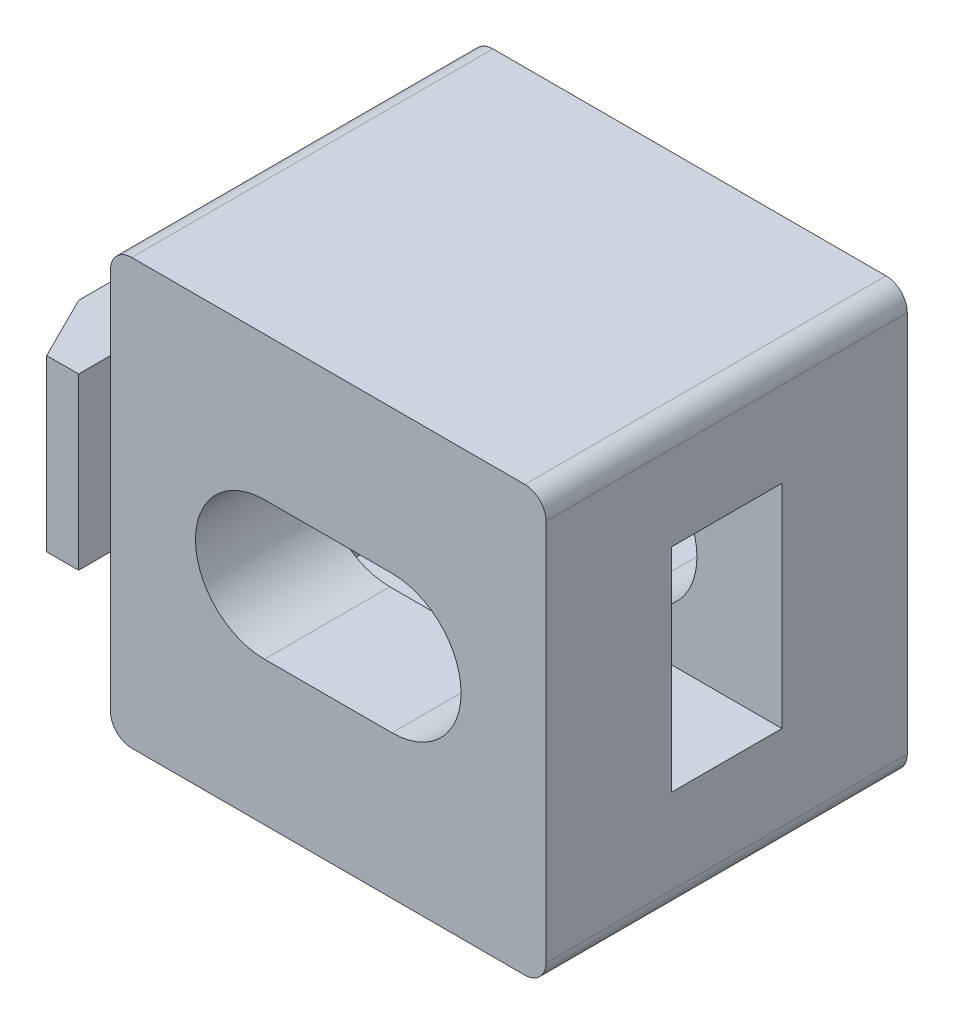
ISO-10303-21;
HEADER;
FILE_DESCRIPTION(('STEP AP214'),'2;1');
FILE_NAME('part.step','',(''),(''),'','','');
FILE_SCHEMA(('AUTOMOTIVE_DESIGN { 1 0 10303 214 1 1 1 1 }'));
ENDSEC;
DATA;
#1=APPLICATION_CONTEXT('core data for automotive mechanical design processes');
#2=APPLICATION_PROTOCOL_DEFINITION('international standard','automotive_design',2000,#1);
#3=PRODUCT_CONTEXT('',#1,'mechanical');
#4=PRODUCT('Part','Part','',(#3));
#5=PRODUCT_RELATED_PRODUCT_CATEGORY('part','',(#4));
#6=PRODUCT_DEFINITION_FORMATION('','',#4);
#7=PRODUCT_DEFINITION_CONTEXT('part definition',#1,'design');
#8=PRODUCT_DEFINITION('design','',#6,#7);
#9=PRODUCT_DEFINITION_SHAPE('','',#8);
#10=(LENGTH_UNIT() NAMED_UNIT(*) SI_UNIT(.MILLI.,.METRE.));
#11=(NAMED_UNIT(*) PLANE_ANGLE_UNIT() SI_UNIT($,.RADIAN.));
#12=(NAMED_UNIT(*) SI_UNIT($,.STERADIAN.) SOLID_ANGLE_UNIT());
#13=UNCERTAINTY_MEASURE_WITH_UNIT(LENGTH_MEASURE(1.E-05),#10,'distance_accuracy_value','');
#14=(GEOMETRIC_REPRESENTATION_CONTEXT(3) GLOBAL_UNCERTAINTY_ASSIGNED_CONTEXT((#13)) GLOBAL_UNIT_ASSIGNED_CONTEXT((#10,
#11,#12)) REPRESENTATION_CONTEXT('',''));
#15=CARTESIAN_POINT('',(0.,0.,0.));
#16=DIRECTION('',(0.,0.,1.));
#17=DIRECTION('',(1.,0.,0.));
#18=AXIS2_PLACEMENT_3D('',#15,#16,#17);
#19=CARTESIAN_POINT('',(-10.25,10.,8.5));
#20=DIRECTION('',(1.,0.,0.));
#21=DIRECTION('',(0.,1.,0.));
#22=AXIS2_PLACEMENT_3D('',#19,#20,#21);
#23=PLANE('',#22);
#24=DIRECTION('',(0.,-1.,0.));
#25=VECTOR('',#24,1.);
#26=CARTESIAN_POINT('',(-10.25,10.,-8.5));
#27=LINE('',#26,#25);
#28=CARTESIAN_POINT('',(-10.25,9.,-8.5));
#29=VERTEX_POINT('',#28);
#30=CARTESIAN_POINT('',(-10.25,-9.,-8.5));
#31=VERTEX_POINT('',#30);
#32=EDGE_CURVE('E377',#29,#31,#27,.T.);
#33=ORIENTED_EDGE('',*,*,#32,.T.);
#34=DIRECTION('',(0.,0.,-1.));
#35=VECTOR('',#34,1.);
#36=CARTESIAN_POINT('',(-10.25,-9.,8.5));
#37=LINE('',#36,#35);
#38=CARTESIAN_POINT('',(-10.25,-9.,8.5));
#39=VERTEX_POINT('',#38);
#40=EDGE_CURVE('E342',#31,#39,#37,.F.);
#41=ORIENTED_EDGE('',*,*,#40,.T.);
#42=DIRECTION('',(0.,-1.,0.));
#43=VECTOR('',#42,1.);
#44=CARTESIAN_POINT('',(-10.25,10.,8.5));
#45=LINE('',#44,#43);
#46=CARTESIAN_POINT('',(-10.25,9.,8.5));
#47=VERTEX_POINT('',#46);
#48=EDGE_CURVE('E375',#47,#39,#45,.T.);
#49=ORIENTED_EDGE('',*,*,#48,.F.);
#50=DIRECTION('',(0.,0.,-1.));
#51=VECTOR('',#50,1.);
#52=CARTESIAN_POINT('',(-10.25,9.,8.5));
#53=LINE('',#52,#51);
#54=EDGE_CURVE('E339',#47,#29,#53,.T.);
#55=ORIENTED_EDGE('',*,*,#54,.T.);
#56=EDGE_LOOP('',(#33,#41,#49,#55));
#57=FACE_BOUND('',#56,.T.);
#58=DIRECTION('',(0.,-1.,0.));
#59=VECTOR('',#58,1.);
#60=CARTESIAN_POINT('',(-10.25,4.,-2.5));
#61=LINE('',#60,#59);
#62=CARTESIAN_POINT('',(-10.25,4.,-2.5));
#63=VERTEX_POINT('',#62);
#64=CARTESIAN_POINT('',(-10.25,-0.999999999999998,-2.5));
#65=VERTEX_POINT('',#64);
#66=EDGE_CURVE('E422',#63,#65,#61,.T.);
#67=ORIENTED_EDGE('',*,*,#66,.F.);
#68=DIRECTION('',(0.,0.,-1.));
#69=VECTOR('',#68,1.);
#70=CARTESIAN_POINT('',(-10.25,4.,-2.5));
#71=LINE('',#70,#69);
#72=CARTESIAN_POINT('',(-10.25,4.,2.5));
#73=VERTEX_POINT('',#72);
#74=EDGE_CURVE('E309',#73,#63,#71,.T.);
#75=ORIENTED_EDGE('',*,*,#74,.F.);
#76=CARTESIAN_POINT('',(-10.25,1.,2.5));
#77=DIRECTION('',(1.,0.,0.));
#78=DIRECTION('',(0.,1.,0.));
#79=AXIS2_PLACEMENT_3D('',#76,#77,#78);
#80=CIRCLE('',#79,3.);
#81=CARTESIAN_POINT('',(-10.25,1.,5.5));
#82=VERTEX_POINT('',#81);
#83=EDGE_CURVE('E328',#73,#82,#80,.T.);
#84=ORIENTED_EDGE('',*,*,#83,.T.);
#85=DIRECTION('',(0.,1.,0.));
#86=VECTOR('',#85,1.);
#87=CARTESIAN_POINT('',(-10.25,4.,5.5));
#88=LINE('',#87,#86);
#89=CARTESIAN_POINT('',(-10.25,-4.,5.5));
#90=VERTEX_POINT('',#89);
#91=EDGE_CURVE('E416',#90,#82,#88,.T.);
#92=ORIENTED_EDGE('',*,*,#91,.F.);
#93=DIRECTION('',(0.,0.,1.));
#94=VECTOR('',#93,1.);
#95=CARTESIAN_POINT('',(-10.25,-4.,-2.5));
#96=LINE('',#95,#94);
#97=CARTESIAN_POINT('',(-10.25,-4.,0.5));
#98=VERTEX_POINT('',#97);
#99=EDGE_CURVE('E424',#98,#90,#96,.T.);
#100=ORIENTED_EDGE('',*,*,#99,.F.);
#101=CARTESIAN_POINT('',(-10.25,-0.999999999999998,0.5));
#102=DIRECTION('',(1.,0.,0.));
#103=DIRECTION('',(0.,1.,0.));
#104=AXIS2_PLACEMENT_3D('',#101,#102,#103);
#105=CIRCLE('',#104,3.);
#106=EDGE_CURVE('E393',#98,#65,#105,.T.);
#107=ORIENTED_EDGE('',*,*,#106,.T.);
#108=EDGE_LOOP('',(#67,#75,#84,#92,#100,#107));
#109=FACE_BOUND('',#108,.T.);
#110=ADVANCED_FACE('F37',(#57,#109),#23,.F.);
#111=CARTESIAN_POINT('',(-3.,0.,8.5));
#112=DIRECTION('',(0.,0.,-1.));
#113=DIRECTION('',(-1.,0.,0.));
#114=AXIS2_PLACEMENT_3D('',#111,#112,#113);
#115=CYLINDRICAL_SURFACE('',#114,3.25);
#116=CARTESIAN_POINT('',(-3.,0.,2.6));
#117=DIRECTION('',(0.,0.,1.));
#118=DIRECTION('',(0.,-1.,0.));
#119=AXIS2_PLACEMENT_3D('',#116,#117,#118);
#120=CIRCLE('',#119,3.25);
#121=CARTESIAN_POINT('',(-3.,3.25,2.6));
#122=VERTEX_POINT('',#121);
#123=CARTESIAN_POINT('',(-3.,-3.25,2.6));
#124=VERTEX_POINT('',#123);
#125=EDGE_CURVE('E469',#122,#124,#120,.T.);
#126=ORIENTED_EDGE('',*,*,#125,.F.);
#127=DIRECTION('',(0.,0.,-1.));
#128=VECTOR('',#127,1.);
#129=CARTESIAN_POINT('',(-3.,3.25,8.5));
#130=LINE('',#129,#128);
#131=CARTESIAN_POINT('',(-3.,3.25,8.5));
#132=VERTEX_POINT('',#131);
#133=EDGE_CURVE('E493',#132,#122,#130,.T.);
#134=ORIENTED_EDGE('',*,*,#133,.F.);
#135=CARTESIAN_POINT('',(-3.,0.,8.5));
#136=DIRECTION('',(0.,0.,1.));
#137=DIRECTION('',(1.,0.,0.));
#138=AXIS2_PLACEMENT_3D('',#135,#136,#137);
#139=CIRCLE('',#138,3.25);
#140=CARTESIAN_POINT('',(-3.,-3.25,8.5));
#141=VERTEX_POINT('',#140);
#142=EDGE_CURVE('E472',#132,#141,#139,.T.);
#143=ORIENTED_EDGE('',*,*,#142,.T.);
#144=DIRECTION('',(0.,0.,-1.));
#145=VECTOR('',#144,1.);
#146=CARTESIAN_POINT('',(-3.,-3.25,8.5));
#147=LINE('',#146,#145);
#148=EDGE_CURVE('E505',#141,#124,#147,.T.);
#149=ORIENTED_EDGE('',*,*,#148,.T.);
#150=EDGE_LOOP('',(#126,#134,#143,#149));
#151=FACE_BOUND('',#150,.T.);
#152=ADVANCED_FACE('F542',(#151),#115,.F.);
#153=CARTESIAN_POINT('',(-3.,-3.25,8.5));
#154=DIRECTION('',(0.,1.,0.));
#155=DIRECTION('',(-1.,0.,0.));
#156=AXIS2_PLACEMENT_3D('',#153,#154,#155);
#157=PLANE('',#156);
#158=DIRECTION('',(1.,0.,0.));
#159=VECTOR('',#158,1.);
#160=CARTESIAN_POINT('',(-3.,-3.25,2.6));
#161=LINE('',#160,#159);
#162=CARTESIAN_POINT('',(3.,-3.25,2.6));
#163=VERTEX_POINT('',#162);
#164=EDGE_CURVE('E467',#124,#163,#161,.T.);
#165=ORIENTED_EDGE('',*,*,#164,.F.);
#166=ORIENTED_EDGE('',*,*,#148,.F.);
#167=DIRECTION('',(1.,0.,0.));
#168=VECTOR('',#167,1.);
#169=CARTESIAN_POINT('',(-3.,-3.25,8.5));
#170=LINE('',#169,#168);
#171=CARTESIAN_POINT('',(3.,-3.25,8.5));
#172=VERTEX_POINT('',#171);
#173=EDGE_CURVE('E474',#141,#172,#170,.T.);
#174=ORIENTED_EDGE('',*,*,#173,.T.);
#175=DIRECTION('',(0.,0.,-1.));
#176=VECTOR('',#175,1.);
#177=CARTESIAN_POINT('',(3.,-3.25,8.5));
#178=LINE('',#177,#176);
#179=EDGE_CURVE('E501',#172,#163,#178,.T.);
#180=ORIENTED_EDGE('',*,*,#179,.T.);
#181=EDGE_LOOP('',(#165,#166,#174,#180));
#182=FACE_BOUND('',#181,.T.);
#183=ADVANCED_FACE('F547',(#182),#157,.T.);
#184=CARTESIAN_POINT('',(3.,0.,8.5));
#185=DIRECTION('',(0.,0.,-1.));
#186=DIRECTION('',(-1.,0.,0.));
#187=AXIS2_PLACEMENT_3D('',#184,#185,#186);
#188=CYLINDRICAL_SURFACE('',#187,3.25);
#189=CARTESIAN_POINT('',(3.,0.,2.6));
#190=DIRECTION('',(0.,0.,1.));
#191=DIRECTION('',(0.,-1.,0.));
#192=AXIS2_PLACEMENT_3D('',#189,#190,#191);
#193=CIRCLE('',#192,3.25);
#194=CARTESIAN_POINT('',(3.,3.25,2.6));
#195=VERTEX_POINT('',#194);
#196=EDGE_CURVE('E465',#163,#195,#193,.T.);
#197=ORIENTED_EDGE('',*,*,#196,.F.);
#198=ORIENTED_EDGE('',*,*,#179,.F.);
#199=CARTESIAN_POINT('',(3.,0.,8.5));
#200=DIRECTION('',(0.,0.,1.));
#201=DIRECTION('',(1.,0.,0.));
#202=AXIS2_PLACEMENT_3D('',#199,#200,#201);
#203=CIRCLE('',#202,3.25);
#204=CARTESIAN_POINT('',(3.,3.25,8.5));
#205=VERTEX_POINT('',#204);
#206=EDGE_CURVE('E477',#172,#205,#203,.T.);
#207=ORIENTED_EDGE('',*,*,#206,.T.);
#208=DIRECTION('',(0.,0.,-1.));
#209=VECTOR('',#208,1.);
#210=CARTESIAN_POINT('',(3.,3.25,8.5));
#211=LINE('',#210,#209);
#212=EDGE_CURVE('E497',#205,#195,#211,.T.);
#213=ORIENTED_EDGE('',*,*,#212,.T.);
#214=EDGE_LOOP('',(#197,#198,#207,#213));
#215=FACE_BOUND('',#214,.T.);
#216=ADVANCED_FACE('F777',(#215),#188,.F.);
#217=CARTESIAN_POINT('',(-3.,3.25,8.5));
#218=DIRECTION('',(0.,-1.,0.));
#219=DIRECTION('',(1.,0.,0.));
#220=AXIS2_PLACEMENT_3D('',#217,#218,#219);
#221=PLANE('',#220);
#222=DIRECTION('',(-1.,0.,0.));
#223=VECTOR('',#222,1.);
#224=CARTESIAN_POINT('',(-3.,3.25,2.6));
#225=LINE('',#224,#223);
#226=EDGE_CURVE('E322',#195,#122,#225,.T.);
#227=ORIENTED_EDGE('',*,*,#226,.F.);
#228=ORIENTED_EDGE('',*,*,#212,.F.);
#229=DIRECTION('',(-1.,0.,0.));
#230=VECTOR('',#229,1.);
#231=CARTESIAN_POINT('',(-3.,3.25,8.5));
#232=LINE('',#231,#230);
#233=EDGE_CURVE('E480',#205,#132,#232,.T.);
#234=ORIENTED_EDGE('',*,*,#233,.T.);
#235=ORIENTED_EDGE('',*,*,#133,.T.);
#236=EDGE_LOOP('',(#227,#228,#234,#235));
#237=FACE_BOUND('',#236,.T.);
#238=ADVANCED_FACE('F765',(#237),#221,.T.);
#239=CARTESIAN_POINT('',(0.,0.,8.5));
#240=DIRECTION('',(0.,0.,1.));
#241=DIRECTION('',(1.,0.,0.));
#242=AXIS2_PLACEMENT_3D('',#239,#240,#241);
#243=PLANE('',#242);
#244=ORIENTED_EDGE('',*,*,#48,.T.);
#245=CARTESIAN_POINT('',(-9.25,-9.,8.5));
#246=DIRECTION('',(0.,0.,1.));
#247=DIRECTION('',(1.,0.,0.));
#248=AXIS2_PLACEMENT_3D('',#245,#246,#247);
#249=CIRCLE('',#248,1.);
#250=CARTESIAN_POINT('',(-9.25,-10.,8.5));
#251=VERTEX_POINT('',#250);
#252=EDGE_CURVE('E349',#39,#251,#249,.T.);
#253=ORIENTED_EDGE('',*,*,#252,.T.);
#254=DIRECTION('',(1.,0.,0.));
#255=VECTOR('',#254,1.);
#256=CARTESIAN_POINT('',(-10.25,-10.,8.5));
#257=LINE('',#256,#255);
#258=CARTESIAN_POINT('',(9.25,-10.,8.5));
#259=VERTEX_POINT('',#258);
#260=EDGE_CURVE('E510',#251,#259,#257,.T.);
#261=ORIENTED_EDGE('',*,*,#260,.T.);
#262=CARTESIAN_POINT('',(9.25,-9.,8.5));
#263=DIRECTION('',(0.,0.,1.));
#264=DIRECTION('',(1.,0.,0.));
#265=AXIS2_PLACEMENT_3D('',#262,#263,#264);
#266=CIRCLE('',#265,1.);
#267=CARTESIAN_POINT('',(10.25,-9.,8.5));
#268=VERTEX_POINT('',#267);
#269=EDGE_CURVE('E347',#259,#268,#266,.T.);
#270=ORIENTED_EDGE('',*,*,#269,.T.);
#271=DIRECTION('',(0.,1.,0.));
#272=VECTOR('',#271,1.);
#273=CARTESIAN_POINT('',(10.25,10.,8.5));
#274=LINE('',#273,#272);
#275=CARTESIAN_POINT('',(10.25,9.,8.5));
#276=VERTEX_POINT('',#275);
#277=EDGE_CURVE('E363',#268,#276,#274,.T.);
#278=ORIENTED_EDGE('',*,*,#277,.T.);
#279=CARTESIAN_POINT('',(9.25,9.,8.5));
#280=DIRECTION('',(0.,0.,1.));
#281=DIRECTION('',(1.,0.,0.));
#282=AXIS2_PLACEMENT_3D('',#279,#280,#281);
#283=CIRCLE('',#282,1.);
#284=CARTESIAN_POINT('',(9.25,10.,8.5));
#285=VERTEX_POINT('',#284);
#286=EDGE_CURVE('E58',#276,#285,#283,.T.);
#287=ORIENTED_EDGE('',*,*,#286,.T.);
#288=DIRECTION('',(-1.,0.,0.));
#289=VECTOR('',#288,1.);
#290=CARTESIAN_POINT('',(-10.25,10.,8.5));
#291=LINE('',#290,#289);
#292=CARTESIAN_POINT('',(-9.25,10.,8.5));
#293=VERTEX_POINT('',#292);
#294=EDGE_CURVE('E383',#285,#293,#291,.T.);
#295=ORIENTED_EDGE('',*,*,#294,.T.);
#296=CARTESIAN_POINT('',(-9.25,9.,8.5));
#297=DIRECTION('',(0.,0.,1.));
#298=DIRECTION('',(1.,0.,0.));
#299=AXIS2_PLACEMENT_3D('',#296,#297,#298);
#300=CIRCLE('',#299,1.);
#301=EDGE_CURVE('E344',#293,#47,#300,.T.);
#302=ORIENTED_EDGE('',*,*,#301,.T.);
#303=EDGE_LOOP('',(#244,#253,#261,#270,#278,#287,#295,#302));
#304=FACE_BOUND('',#303,.T.);
#305=ORIENTED_EDGE('',*,*,#173,.F.);
#306=ORIENTED_EDGE('',*,*,#142,.F.);
#307=ORIENTED_EDGE('',*,*,#233,.F.);
#308=ORIENTED_EDGE('',*,*,#206,.F.);
#309=EDGE_LOOP('',(#305,#306,#307,#308));
#310=FACE_BOUND('',#309,.T.);
#311=ADVANCED_FACE('F525',(#304,#310),#243,.T.);
#312=CARTESIAN_POINT('',(0.,0.,-8.5));
#313=DIRECTION('',(0.,0.,1.));
#314=DIRECTION('',(1.,0.,0.));
#315=AXIS2_PLACEMENT_3D('',#312,#313,#314);
#316=PLANE('',#315);
#317=DIRECTION('',(1.,0.,0.));
#318=VECTOR('',#317,1.);
#319=CARTESIAN_POINT('',(-10.25,-10.,-8.5));
#320=LINE('',#319,#318);
#321=CARTESIAN_POINT('',(-9.25,-10.,-8.5));
#322=VERTEX_POINT('',#321);
#323=CARTESIAN_POINT('',(9.25,-10.,-8.5));
#324=VERTEX_POINT('',#323);
#325=EDGE_CURVE('E373',#322,#324,#320,.T.);
#326=ORIENTED_EDGE('',*,*,#325,.F.);
#327=CARTESIAN_POINT('',(-9.25,-9.,-8.5));
#328=DIRECTION('',(0.,0.,1.));
#329=DIRECTION('',(1.,0.,0.));
#330=AXIS2_PLACEMENT_3D('',#327,#328,#329);
#331=CIRCLE('',#330,1.);
#332=EDGE_CURVE('E337',#322,#31,#331,.F.);
#333=ORIENTED_EDGE('',*,*,#332,.T.);
#334=ORIENTED_EDGE('',*,*,#32,.F.);
#335=CARTESIAN_POINT('',(-9.25,9.,-8.5));
#336=DIRECTION('',(0.,0.,1.));
#337=DIRECTION('',(1.,0.,0.));
#338=AXIS2_PLACEMENT_3D('',#335,#336,#337);
#339=CIRCLE('',#338,1.);
#340=CARTESIAN_POINT('',(-9.25,10.,-8.5));
#341=VERTEX_POINT('',#340);
#342=EDGE_CURVE('E331',#29,#341,#339,.F.);
#343=ORIENTED_EDGE('',*,*,#342,.T.);
#344=DIRECTION('',(-1.,0.,0.));
#345=VECTOR('',#344,1.);
#346=CARTESIAN_POINT('',(-10.25,10.,-8.5));
#347=LINE('',#346,#345);
#348=CARTESIAN_POINT('',(9.25,10.,-8.5));
#349=VERTEX_POINT('',#348);
#350=EDGE_CURVE('E372',#349,#341,#347,.T.);
#351=ORIENTED_EDGE('',*,*,#350,.F.);
#352=CARTESIAN_POINT('',(9.25,9.,-8.5));
#353=DIRECTION('',(0.,0.,1.));
#354=DIRECTION('',(1.,0.,0.));
#355=AXIS2_PLACEMENT_3D('',#352,#353,#354);
#356=CIRCLE('',#355,1.);
#357=CARTESIAN_POINT('',(10.25,9.,-8.5));
#358=VERTEX_POINT('',#357);
#359=EDGE_CURVE('E333',#349,#358,#356,.F.);
#360=ORIENTED_EDGE('',*,*,#359,.T.);
#361=DIRECTION('',(0.,1.,0.));
#362=VECTOR('',#361,1.);
#363=CARTESIAN_POINT('',(10.25,10.,-8.5));
#364=LINE('',#363,#362);
#365=CARTESIAN_POINT('',(10.25,-9.,-8.5));
#366=VERTEX_POINT('',#365);
#367=EDGE_CURVE('E361',#366,#358,#364,.T.);
#368=ORIENTED_EDGE('',*,*,#367,.F.);
#369=CARTESIAN_POINT('',(9.25,-9.,-8.5));
#370=DIRECTION('',(0.,0.,1.));
#371=DIRECTION('',(1.,0.,0.));
#372=AXIS2_PLACEMENT_3D('',#369,#370,#371);
#373=CIRCLE('',#372,1.);
#374=EDGE_CURVE('E335',#366,#324,#373,.F.);
#375=ORIENTED_EDGE('',*,*,#374,.T.);
#376=EDGE_LOOP('',(#326,#333,#334,#343,#351,#360,#368,#375));
#377=FACE_BOUND('',#376,.T.);
#378=CARTESIAN_POINT('',(-3.,0.,-8.5));
#379=DIRECTION('',(0.,0.,1.));
#380=DIRECTION('',(1.,0.,0.));
#381=AXIS2_PLACEMENT_3D('',#378,#379,#380);
#382=CIRCLE('',#381,3.25);
#383=CARTESIAN_POINT('',(-3.,3.25,-8.5));
#384=VERTEX_POINT('',#383);
#385=CARTESIAN_POINT('',(-3.,-3.25,-8.5));
#386=VERTEX_POINT('',#385);
#387=EDGE_CURVE('E471',#384,#386,#382,.T.);
#388=ORIENTED_EDGE('',*,*,#387,.T.);
#389=DIRECTION('',(1.,0.,0.));
#390=VECTOR('',#389,1.);
#391=CARTESIAN_POINT('',(-3.,-3.25,-8.5));
#392=LINE('',#391,#390);
#393=CARTESIAN_POINT('',(3.,-3.25,-8.5));
#394=VERTEX_POINT('',#393);
#395=EDGE_CURVE('E485',#386,#394,#392,.T.);
#396=ORIENTED_EDGE('',*,*,#395,.T.);
#397=CARTESIAN_POINT('',(3.,0.,-8.5));
#398=DIRECTION('',(0.,0.,1.));
#399=DIRECTION('',(1.,0.,0.));
#400=AXIS2_PLACEMENT_3D('',#397,#398,#399);
#401=CIRCLE('',#400,3.25);
#402=CARTESIAN_POINT('',(3.,3.25,-8.5));
#403=VERTEX_POINT('',#402);
#404=EDGE_CURVE('E488',#394,#403,#401,.T.);
#405=ORIENTED_EDGE('',*,*,#404,.T.);
#406=DIRECTION('',(-1.,0.,0.));
#407=VECTOR('',#406,1.);
#408=CARTESIAN_POINT('',(-3.,3.25,-8.5));
#409=LINE('',#408,#407);
#410=EDGE_CURVE('E475',#403,#384,#409,.T.);
#411=ORIENTED_EDGE('',*,*,#410,.T.);
#412=EDGE_LOOP('',(#388,#396,#405,#411));
#413=FACE_BOUND('',#412,.T.);
#414=ADVANCED_FACE('F368',(#377,#413),#316,.F.);
#415=CARTESIAN_POINT('',(-10.25,-10.,8.5));
#416=DIRECTION('',(0.,1.,0.));
#417=DIRECTION('',(-1.,0.,0.));
#418=AXIS2_PLACEMENT_3D('',#415,#416,#417);
#419=PLANE('',#418);
#420=ORIENTED_EDGE('',*,*,#260,.F.);
#421=DIRECTION('',(0.,0.,-1.));
#422=VECTOR('',#421,1.);
#423=CARTESIAN_POINT('',(-9.25,-10.,8.5));
#424=LINE('',#423,#422);
#425=EDGE_CURVE('E327',#251,#322,#424,.T.);
#426=ORIENTED_EDGE('',*,*,#425,.T.);
#427=ORIENTED_EDGE('',*,*,#325,.T.);
#428=DIRECTION('',(0.,0.,-1.));
#429=VECTOR('',#428,1.);
#430=CARTESIAN_POINT('',(9.25,-10.,8.5));
#431=LINE('',#430,#429);
#432=EDGE_CURVE('E325',#324,#259,#431,.F.);
#433=ORIENTED_EDGE('',*,*,#432,.T.);
#434=EDGE_LOOP('',(#420,#426,#427,#433));
#435=FACE_BOUND('',#434,.T.);
#436=ADVANCED_FACE('F528',(#435),#419,.F.);
#437=CARTESIAN_POINT('',(10.25,10.,8.5));
#438=DIRECTION('',(-1.,0.,0.));
#439=DIRECTION('',(0.,-1.,0.));
#440=AXIS2_PLACEMENT_3D('',#437,#438,#439);
#441=PLANE('',#440);
#442=DIRECTION('',(0.,0.,-1.));
#443=VECTOR('',#442,1.);
#444=CARTESIAN_POINT('',(10.25,-5.,2.6));
#445=LINE('',#444,#443);
#446=CARTESIAN_POINT('',(10.25,-5.,2.6));
#447=VERTEX_POINT('',#446);
#448=CARTESIAN_POINT('',(10.25,-5.,-2.6));
#449=VERTEX_POINT('',#448);
#450=EDGE_CURVE('E443',#447,#449,#445,.T.);
#451=ORIENTED_EDGE('',*,*,#450,.F.);
#452=DIRECTION('',(0.,-1.,0.));
#453=VECTOR('',#452,1.);
#454=CARTESIAN_POINT('',(10.25,5.,2.6));
#455=LINE('',#454,#453);
#456=CARTESIAN_POINT('',(10.25,5.,2.6));
#457=VERTEX_POINT('',#456);
#458=EDGE_CURVE('E403',#457,#447,#455,.T.);
#459=ORIENTED_EDGE('',*,*,#458,.F.);
#460=DIRECTION('',(0.,0.,1.));
#461=VECTOR('',#460,1.);
#462=CARTESIAN_POINT('',(10.25,5.,2.6));
#463=LINE('',#462,#461);
#464=CARTESIAN_POINT('',(10.25,5.,-2.6));
#465=VERTEX_POINT('',#464);
#466=EDGE_CURVE('E432',#465,#457,#463,.T.);
#467=ORIENTED_EDGE('',*,*,#466,.F.);
#468=DIRECTION('',(0.,1.,0.));
#469=VECTOR('',#468,1.);
#470=CARTESIAN_POINT('',(10.25,5.,-2.6));
#471=LINE('',#470,#469);
#472=EDGE_CURVE('E446',#449,#465,#471,.T.);
#473=ORIENTED_EDGE('',*,*,#472,.F.);
#474=EDGE_LOOP('',(#451,#459,#467,#473));
#475=FACE_BOUND('',#474,.T.);
#476=ORIENTED_EDGE('',*,*,#277,.F.);
#477=DIRECTION('',(0.,0.,-1.));
#478=VECTOR('',#477,1.);
#479=CARTESIAN_POINT('',(10.25,-9.,8.5));
#480=LINE('',#479,#478);
#481=EDGE_CURVE('E353',#268,#366,#480,.T.);
#482=ORIENTED_EDGE('',*,*,#481,.T.);
#483=ORIENTED_EDGE('',*,*,#367,.T.);
#484=DIRECTION('',(0.,0.,-1.));
#485=VECTOR('',#484,1.);
#486=CARTESIAN_POINT('',(10.25,9.,8.5));
#487=LINE('',#486,#485);
#488=EDGE_CURVE('E351',#358,#276,#487,.F.);
#489=ORIENTED_EDGE('',*,*,#488,.T.);
#490=EDGE_LOOP('',(#476,#482,#483,#489));
#491=FACE_BOUND('',#490,.T.);
#492=ADVANCED_FACE('F360',(#475,#491),#441,.F.);
#493=CARTESIAN_POINT('',(-10.25,10.,8.5));
#494=DIRECTION('',(0.,-1.,0.));
#495=DIRECTION('',(1.,0.,0.));
#496=AXIS2_PLACEMENT_3D('',#493,#494,#495);
#497=PLANE('',#496);
#498=ORIENTED_EDGE('',*,*,#294,.F.);
#499=DIRECTION('',(0.,0.,-1.));
#500=VECTOR('',#499,1.);
#501=CARTESIAN_POINT('',(9.25,10.,8.5));
#502=LINE('',#501,#500);
#503=EDGE_CURVE('E11',#285,#349,#502,.T.);
#504=ORIENTED_EDGE('',*,*,#503,.T.);
#505=ORIENTED_EDGE('',*,*,#350,.T.);
#506=DIRECTION('',(0.,0.,-1.));
#507=VECTOR('',#506,1.);
#508=CARTESIAN_POINT('',(-9.25,10.,8.5));
#509=LINE('',#508,#507);
#510=EDGE_CURVE('E45',#341,#293,#509,.F.);
#511=ORIENTED_EDGE('',*,*,#510,.T.);
#512=EDGE_LOOP('',(#498,#504,#505,#511));
#513=FACE_BOUND('',#512,.T.);
#514=ADVANCED_FACE('F534',(#513),#497,.F.);
#515=CARTESIAN_POINT('',(-3.,0.,-2.6));
#516=DIRECTION('',(0.,0.,-1.));
#517=DIRECTION('',(0.,1.,0.));
#518=AXIS2_PLACEMENT_3D('',#515,#516,#517);
#519=CIRCLE('',#518,3.25);
#520=CARTESIAN_POINT('',(-3.,-3.25,-2.6));
#521=VERTEX_POINT('',#520);
#522=CARTESIAN_POINT('',(-3.,3.25,-2.6));
#523=VERTEX_POINT('',#522);
#524=EDGE_CURVE('E463',#521,#523,#519,.T.);
#525=ORIENTED_EDGE('',*,*,#524,.F.);
#526=EDGE_CURVE('E504',#521,#386,#147,.T.);
#527=ORIENTED_EDGE('',*,*,#526,.T.);
#528=ORIENTED_EDGE('',*,*,#387,.F.);
#529=EDGE_CURVE('E482',#523,#384,#130,.T.);
#530=ORIENTED_EDGE('',*,*,#529,.F.);
#531=EDGE_LOOP('',(#525,#527,#528,#530));
#532=FACE_BOUND('',#531,.T.);
#533=ADVANCED_FACE('F550',(#532),#115,.F.);
#534=DIRECTION('',(-1.,0.,0.));
#535=VECTOR('',#534,1.);
#536=CARTESIAN_POINT('',(-3.,-3.25,-2.6));
#537=LINE('',#536,#535);
#538=CARTESIAN_POINT('',(3.,-3.25,-2.6));
#539=VERTEX_POINT('',#538);
#540=EDGE_CURVE('E461',#539,#521,#537,.T.);
#541=ORIENTED_EDGE('',*,*,#540,.F.);
#542=EDGE_CURVE('E500',#539,#394,#178,.T.);
#543=ORIENTED_EDGE('',*,*,#542,.T.);
#544=ORIENTED_EDGE('',*,*,#395,.F.);
#545=ORIENTED_EDGE('',*,*,#526,.F.);
#546=EDGE_LOOP('',(#541,#543,#544,#545));
#547=FACE_BOUND('',#546,.T.);
#548=ADVANCED_FACE('F774',(#547),#157,.T.);
#549=CARTESIAN_POINT('',(3.,0.,-2.6));
#550=DIRECTION('',(0.,0.,-1.));
#551=DIRECTION('',(0.,1.,0.));
#552=AXIS2_PLACEMENT_3D('',#549,#550,#551);
#553=CIRCLE('',#552,3.25);
#554=CARTESIAN_POINT('',(3.,3.25,-2.6));
#555=VERTEX_POINT('',#554);
#556=EDGE_CURVE('E453',#555,#539,#553,.T.);
#557=ORIENTED_EDGE('',*,*,#556,.F.);
#558=EDGE_CURVE('E496',#555,#403,#211,.T.);
#559=ORIENTED_EDGE('',*,*,#558,.T.);
#560=ORIENTED_EDGE('',*,*,#404,.F.);
#561=ORIENTED_EDGE('',*,*,#542,.F.);
#562=EDGE_LOOP('',(#557,#559,#560,#561));
#563=FACE_BOUND('',#562,.T.);
#564=ADVANCED_FACE('F762',(#563),#188,.F.);
#565=DIRECTION('',(1.,0.,0.));
#566=VECTOR('',#565,1.);
#567=CARTESIAN_POINT('',(-3.,3.25,-2.6));
#568=LINE('',#567,#566);
#569=EDGE_CURVE('E381',#523,#555,#568,.T.);
#570=ORIENTED_EDGE('',*,*,#569,.F.);
#571=ORIENTED_EDGE('',*,*,#529,.T.);
#572=ORIENTED_EDGE('',*,*,#410,.F.);
#573=ORIENTED_EDGE('',*,*,#558,.F.);
#574=EDGE_LOOP('',(#570,#571,#572,#573));
#575=FACE_BOUND('',#574,.T.);
#576=ADVANCED_FACE('F751',(#575),#221,.T.);
#577=CARTESIAN_POINT('',(-6.75,5.,2.6));
#578=DIRECTION('',(0.,0.,1.));
#579=DIRECTION('',(0.,-1.,0.));
#580=AXIS2_PLACEMENT_3D('',#577,#578,#579);
#581=PLANE('',#580);
#582=ORIENTED_EDGE('',*,*,#125,.T.);
#583=ORIENTED_EDGE('',*,*,#164,.T.);
#584=ORIENTED_EDGE('',*,*,#196,.T.);
#585=ORIENTED_EDGE('',*,*,#226,.T.);
#586=EDGE_LOOP('',(#582,#583,#584,#585));
#587=FACE_BOUND('',#586,.T.);
#588=ORIENTED_EDGE('',*,*,#458,.T.);
#589=DIRECTION('',(1.,0.,0.));
#590=VECTOR('',#589,1.);
#591=CARTESIAN_POINT('',(-6.75,-5.,2.6));
#592=LINE('',#591,#590);
#593=CARTESIAN_POINT('',(-6.75,-5.,2.6));
#594=VERTEX_POINT('',#593);
#595=EDGE_CURVE('E441',#594,#447,#592,.T.);
#596=ORIENTED_EDGE('',*,*,#595,.F.);
#597=DIRECTION('',(0.,-1.,0.));
#598=VECTOR('',#597,1.);
#599=CARTESIAN_POINT('',(-6.75,5.,2.6));
#600=LINE('',#599,#598);
#601=CARTESIAN_POINT('',(-6.75,5.,2.6));
#602=VERTEX_POINT('',#601);
#603=EDGE_CURVE('E428',#602,#594,#600,.T.);
#604=ORIENTED_EDGE('',*,*,#603,.F.);
#605=DIRECTION('',(1.,0.,0.));
#606=VECTOR('',#605,1.);
#607=CARTESIAN_POINT('',(-6.75,5.,2.6));
#608=LINE('',#607,#606);
#609=EDGE_CURVE('E451',#602,#457,#608,.T.);
#610=ORIENTED_EDGE('',*,*,#609,.T.);
#611=EDGE_LOOP('',(#588,#596,#604,#610));
#612=FACE_BOUND('',#611,.T.);
#613=ADVANCED_FACE('F741',(#587,#612),#581,.F.);
#614=CARTESIAN_POINT('',(-6.75,5.,2.6));
#615=DIRECTION('',(0.,1.,0.));
#616=DIRECTION('',(-1.,0.,0.));
#617=AXIS2_PLACEMENT_3D('',#614,#615,#616);
#618=PLANE('',#617);
#619=ORIENTED_EDGE('',*,*,#466,.T.);
#620=ORIENTED_EDGE('',*,*,#609,.F.);
#621=DIRECTION('',(0.,0.,1.));
#622=VECTOR('',#621,1.);
#623=CARTESIAN_POINT('',(-6.75,5.,2.6));
#624=LINE('',#623,#622);
#625=CARTESIAN_POINT('',(-6.75,5.,-2.6));
#626=VERTEX_POINT('',#625);
#627=EDGE_CURVE('E438',#626,#602,#624,.T.);
#628=ORIENTED_EDGE('',*,*,#627,.F.);
#629=DIRECTION('',(1.,0.,0.));
#630=VECTOR('',#629,1.);
#631=CARTESIAN_POINT('',(-6.75,5.,-2.6));
#632=LINE('',#631,#630);
#633=EDGE_CURVE('E454',#626,#465,#632,.T.);
#634=ORIENTED_EDGE('',*,*,#633,.T.);
#635=EDGE_LOOP('',(#619,#620,#628,#634));
#636=FACE_BOUND('',#635,.T.);
#637=ADVANCED_FACE('F731',(#636),#618,.F.);
#638=CARTESIAN_POINT('',(-6.75,5.,-2.6));
#639=DIRECTION('',(0.,0.,-1.));
#640=DIRECTION('',(0.,1.,0.));
#641=AXIS2_PLACEMENT_3D('',#638,#639,#640);
#642=PLANE('',#641);
#643=ORIENTED_EDGE('',*,*,#524,.T.);
#644=ORIENTED_EDGE('',*,*,#569,.T.);
#645=ORIENTED_EDGE('',*,*,#556,.T.);
#646=ORIENTED_EDGE('',*,*,#540,.T.);
#647=EDGE_LOOP('',(#643,#644,#645,#646));
#648=FACE_BOUND('',#647,.T.);
#649=ORIENTED_EDGE('',*,*,#472,.T.);
#650=ORIENTED_EDGE('',*,*,#633,.F.);
#651=DIRECTION('',(0.,1.,0.));
#652=VECTOR('',#651,1.);
#653=CARTESIAN_POINT('',(-6.75,5.,-2.6));
#654=LINE('',#653,#652);
#655=CARTESIAN_POINT('',(-6.75,-5.,-2.6));
#656=VERTEX_POINT('',#655);
#657=EDGE_CURVE('E435',#656,#626,#654,.T.);
#658=ORIENTED_EDGE('',*,*,#657,.F.);
#659=DIRECTION('',(1.,0.,0.));
#660=VECTOR('',#659,1.);
#661=CARTESIAN_POINT('',(-6.75,-5.,-2.6));
#662=LINE('',#661,#660);
#663=EDGE_CURVE('E456',#656,#449,#662,.T.);
#664=ORIENTED_EDGE('',*,*,#663,.T.);
#665=EDGE_LOOP('',(#649,#650,#658,#664));
#666=FACE_BOUND('',#665,.T.);
#667=ADVANCED_FACE('F721',(#648,#666),#642,.F.);
#668=CARTESIAN_POINT('',(-6.75,-5.,2.6));
#669=DIRECTION('',(0.,-1.,0.));
#670=DIRECTION('',(1.,0.,0.));
#671=AXIS2_PLACEMENT_3D('',#668,#669,#670);
#672=PLANE('',#671);
#673=ORIENTED_EDGE('',*,*,#450,.T.);
#674=ORIENTED_EDGE('',*,*,#663,.F.);
#675=DIRECTION('',(0.,0.,-1.));
#676=VECTOR('',#675,1.);
#677=CARTESIAN_POINT('',(-6.75,-5.,2.6));
#678=LINE('',#677,#676);
#679=EDGE_CURVE('E431',#594,#656,#678,.T.);
#680=ORIENTED_EDGE('',*,*,#679,.F.);
#681=ORIENTED_EDGE('',*,*,#595,.T.);
#682=EDGE_LOOP('',(#673,#674,#680,#681));
#683=FACE_BOUND('',#682,.T.);
#684=ADVANCED_FACE('F711',(#683),#672,.F.);
#685=CARTESIAN_POINT('',(-6.75,0.,0.));
#686=DIRECTION('',(1.,0.,0.));
#687=DIRECTION('',(0.,0.,-1.));
#688=AXIS2_PLACEMENT_3D('',#685,#686,#687);
#689=PLANE('',#688);
#690=ORIENTED_EDGE('',*,*,#603,.T.);
#691=ORIENTED_EDGE('',*,*,#679,.T.);
#692=ORIENTED_EDGE('',*,*,#657,.T.);
#693=ORIENTED_EDGE('',*,*,#627,.T.);
#694=EDGE_LOOP('',(#690,#691,#692,#693));
#695=FACE_BOUND('',#694,.T.);
#696=ADVANCED_FACE('F701',(#695),#689,.T.);
#697=CARTESIAN_POINT('',(-11.75,4.,-2.5));
#698=DIRECTION('',(0.,0.,1.));
#699=DIRECTION('',(0.,-1.,0.));
#700=AXIS2_PLACEMENT_3D('',#697,#698,#699);
#701=PLANE('',#700);
#702=ORIENTED_EDGE('',*,*,#66,.T.);
#703=DIRECTION('',(1.,0.,0.));
#704=VECTOR('',#703,1.);
#705=CARTESIAN_POINT('',(-11.75,-0.999999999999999,-2.5));
#706=LINE('',#705,#704);
#707=CARTESIAN_POINT('',(-11.75,-0.999999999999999,-2.5));
#708=VERTEX_POINT('',#707);
#709=EDGE_CURVE('E321',#65,#708,#706,.F.);
#710=ORIENTED_EDGE('',*,*,#709,.T.);
#711=DIRECTION('',(0.,-1.,0.));
#712=VECTOR('',#711,1.);
#713=CARTESIAN_POINT('',(-11.75,4.,-2.5));
#714=LINE('',#713,#712);
#715=CARTESIAN_POINT('',(-11.75,4.,-2.5));
#716=VERTEX_POINT('',#715);
#717=EDGE_CURVE('E306',#716,#708,#714,.T.);
#718=ORIENTED_EDGE('',*,*,#717,.F.);
#719=DIRECTION('',(1.,0.,0.));
#720=VECTOR('',#719,1.);
#721=CARTESIAN_POINT('',(-11.75,4.,-2.5));
#722=LINE('',#721,#720);
#723=EDGE_CURVE('E395',#716,#63,#722,.T.);
#724=ORIENTED_EDGE('',*,*,#723,.T.);
#725=EDGE_LOOP('',(#702,#710,#718,#724));
#726=FACE_BOUND('',#725,.T.);
#727=ADVANCED_FACE('F659',(#726),#701,.F.);
#728=CARTESIAN_POINT('',(-11.75,-4.,-2.5));
#729=DIRECTION('',(0.,1.,0.));
#730=DIRECTION('',(-1.,0.,0.));
#731=AXIS2_PLACEMENT_3D('',#728,#729,#730);
#732=PLANE('',#731);
#733=DIRECTION('',(1.,0.,0.));
#734=VECTOR('',#733,1.);
#735=CARTESIAN_POINT('',(-11.75,-4.,5.5));
#736=LINE('',#735,#734);
#737=CARTESIAN_POINT('',(-11.75,-4.,5.5));
#738=VERTEX_POINT('',#737);
#739=EDGE_CURVE('E397',#738,#90,#736,.T.);
#740=ORIENTED_EDGE('',*,*,#739,.F.);
#741=DIRECTION('',(0.,0.,1.));
#742=VECTOR('',#741,1.);
#743=CARTESIAN_POINT('',(-11.75,-4.,5.5));
#744=LINE('',#743,#742);
#745=CARTESIAN_POINT('',(-11.75,-4.,8.5));
#746=VERTEX_POINT('',#745);
#747=EDGE_CURVE('E279',#738,#746,#744,.T.);
#748=ORIENTED_EDGE('',*,*,#747,.T.);
#749=DIRECTION('',(-1.,0.,0.));
#750=VECTOR('',#749,1.);
#751=CARTESIAN_POINT('',(-11.75,-4.,8.5));
#752=LINE('',#751,#750);
#753=CARTESIAN_POINT('',(-13.25,-4.,8.5));
#754=VERTEX_POINT('',#753);
#755=EDGE_CURVE('E284',#746,#754,#752,.T.);
#756=ORIENTED_EDGE('',*,*,#755,.T.);
#757=DIRECTION('',(-0.447213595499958,0.,-0.894427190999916));
#758=VECTOR('',#757,1.);
#759=CARTESIAN_POINT('',(-13.25,-4.,8.5));
#760=LINE('',#759,#758);
#761=CARTESIAN_POINT('',(-14.75,-4.,5.5));
#762=VERTEX_POINT('',#761);
#763=EDGE_CURVE('E282',#754,#762,#760,.T.);
#764=ORIENTED_EDGE('',*,*,#763,.T.);
#765=DIRECTION('',(0.,0.,1.));
#766=VECTOR('',#765,1.);
#767=CARTESIAN_POINT('',(-14.75,-4.,-2.5));
#768=LINE('',#767,#766);
#769=CARTESIAN_POINT('',(-14.75,-4.,-2.5));
#770=VERTEX_POINT('',#769);
#771=EDGE_CURVE('E266',#770,#762,#768,.T.);
#772=ORIENTED_EDGE('',*,*,#771,.F.);
#773=DIRECTION('',(-0.447213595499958,0.,0.894427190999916));
#774=VECTOR('',#773,1.);
#775=CARTESIAN_POINT('',(-13.25,-4.,-5.5));
#776=LINE('',#775,#774);
#777=CARTESIAN_POINT('',(-13.25,-4.,-5.5));
#778=VERTEX_POINT('',#777);
#779=EDGE_CURVE('E920',#778,#770,#776,.T.);
#780=ORIENTED_EDGE('',*,*,#779,.F.);
#781=DIRECTION('',(-1.,0.,0.));
#782=VECTOR('',#781,1.);
#783=CARTESIAN_POINT('',(-11.75,-4.,-5.5));
#784=LINE('',#783,#782);
#785=CARTESIAN_POINT('',(-11.75,-4.,-5.5));
#786=VERTEX_POINT('',#785);
#787=EDGE_CURVE('E919',#786,#778,#784,.T.);
#788=ORIENTED_EDGE('',*,*,#787,.F.);
#789=DIRECTION('',(0.,0.,-1.));
#790=VECTOR('',#789,1.);
#791=CARTESIAN_POINT('',(-11.75,-4.,-2.5));
#792=LINE('',#791,#790);
#793=CARTESIAN_POINT('',(-11.75,-4.,0.5));
#794=VERTEX_POINT('',#793);
#795=EDGE_CURVE('E270',#794,#786,#792,.T.);
#796=ORIENTED_EDGE('',*,*,#795,.F.);
#797=DIRECTION('',(1.,0.,0.));
#798=VECTOR('',#797,1.);
#799=CARTESIAN_POINT('',(-11.75,-4.,0.5));
#800=LINE('',#799,#798);
#801=EDGE_CURVE('E318',#794,#98,#800,.T.);
#802=ORIENTED_EDGE('',*,*,#801,.T.);
#803=ORIENTED_EDGE('',*,*,#99,.T.);
#804=EDGE_LOOP('',(#740,#748,#756,#764,#772,#780,#788,#796,#802,#803));
#805=FACE_BOUND('',#804,.T.);
#806=ADVANCED_FACE('F649',(#805),#732,.F.);
#807=CARTESIAN_POINT('',(-11.75,4.,5.5));
#808=DIRECTION('',(0.,0.,-1.));
#809=DIRECTION('',(0.,1.,0.));
#810=AXIS2_PLACEMENT_3D('',#807,#808,#809);
#811=PLANE('',#810);
#812=ORIENTED_EDGE('',*,*,#91,.T.);
#813=DIRECTION('',(1.,0.,0.));
#814=VECTOR('',#813,1.);
#815=CARTESIAN_POINT('',(-11.75,1.,5.5));
#816=LINE('',#815,#814);
#817=CARTESIAN_POINT('',(-11.75,1.,5.5));
#818=VERTEX_POINT('',#817);
#819=EDGE_CURVE('E391',#82,#818,#816,.F.);
#820=ORIENTED_EDGE('',*,*,#819,.T.);
#821=DIRECTION('',(0.,1.,0.));
#822=VECTOR('',#821,1.);
#823=CARTESIAN_POINT('',(-11.75,4.,5.5));
#824=LINE('',#823,#822);
#825=EDGE_CURVE('E303',#738,#818,#824,.T.);
#826=ORIENTED_EDGE('',*,*,#825,.F.);
#827=ORIENTED_EDGE('',*,*,#739,.T.);
#828=EDGE_LOOP('',(#812,#820,#826,#827));
#829=FACE_BOUND('',#828,.T.);
#830=ADVANCED_FACE('F413',(#829),#811,.F.);
#831=CARTESIAN_POINT('',(-11.75,4.,-2.5));
#832=DIRECTION('',(0.,-1.,0.));
#833=DIRECTION('',(1.,0.,0.));
#834=AXIS2_PLACEMENT_3D('',#831,#832,#833);
#835=PLANE('',#834);
#836=DIRECTION('',(0.,0.,1.));
#837=VECTOR('',#836,1.);
#838=CARTESIAN_POINT('',(-11.75,4.,5.5));
#839=LINE('',#838,#837);
#840=CARTESIAN_POINT('',(-11.75,4.,2.5));
#841=VERTEX_POINT('',#840);
#842=CARTESIAN_POINT('',(-11.75,4.,8.5));
#843=VERTEX_POINT('',#842);
#844=EDGE_CURVE('E275',#841,#843,#839,.T.);
#845=ORIENTED_EDGE('',*,*,#844,.F.);
#846=DIRECTION('',(1.,0.,0.));
#847=VECTOR('',#846,1.);
#848=CARTESIAN_POINT('',(-11.75,4.,2.5));
#849=LINE('',#848,#847);
#850=EDGE_CURVE('E314',#841,#73,#849,.T.);
#851=ORIENTED_EDGE('',*,*,#850,.T.);
#852=ORIENTED_EDGE('',*,*,#74,.T.);
#853=ORIENTED_EDGE('',*,*,#723,.F.);
#854=DIRECTION('',(0.,0.,-1.));
#855=VECTOR('',#854,1.);
#856=CARTESIAN_POINT('',(-11.75,4.,-2.5));
#857=LINE('',#856,#855);
#858=CARTESIAN_POINT('',(-11.75,4.,-5.5));
#859=VERTEX_POINT('',#858);
#860=EDGE_CURVE('E296',#716,#859,#857,.T.);
#861=ORIENTED_EDGE('',*,*,#860,.T.);
#862=DIRECTION('',(-1.,0.,0.));
#863=VECTOR('',#862,1.);
#864=CARTESIAN_POINT('',(-11.75,4.,-5.5));
#865=LINE('',#864,#863);
#866=CARTESIAN_POINT('',(-13.25,4.,-5.5));
#867=VERTEX_POINT('',#866);
#868=EDGE_CURVE('E293',#859,#867,#865,.T.);
#869=ORIENTED_EDGE('',*,*,#868,.T.);
#870=DIRECTION('',(-0.447213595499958,0.,0.894427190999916));
#871=VECTOR('',#870,1.);
#872=CARTESIAN_POINT('',(-13.25,4.,-5.5));
#873=LINE('',#872,#871);
#874=CARTESIAN_POINT('',(-14.75,4.,-2.5));
#875=VERTEX_POINT('',#874);
#876=EDGE_CURVE('E256',#867,#875,#873,.T.);
#877=ORIENTED_EDGE('',*,*,#876,.T.);
#878=DIRECTION('',(0.,0.,1.));
#879=VECTOR('',#878,1.);
#880=CARTESIAN_POINT('',(-14.75,4.,-2.5));
#881=LINE('',#880,#879);
#882=CARTESIAN_POINT('',(-14.75,4.,5.5));
#883=VERTEX_POINT('',#882);
#884=EDGE_CURVE('E247',#875,#883,#881,.T.);
#885=ORIENTED_EDGE('',*,*,#884,.T.);
#886=DIRECTION('',(-0.447213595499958,0.,-0.894427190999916));
#887=VECTOR('',#886,1.);
#888=CARTESIAN_POINT('',(-13.25,4.,8.5));
#889=LINE('',#888,#887);
#890=CARTESIAN_POINT('',(-13.25,4.,8.5));
#891=VERTEX_POINT('',#890);
#892=EDGE_CURVE('E253',#891,#883,#889,.T.);
#893=ORIENTED_EDGE('',*,*,#892,.F.);
#894=DIRECTION('',(-1.,0.,0.));
#895=VECTOR('',#894,1.);
#896=CARTESIAN_POINT('',(-11.75,4.,8.5));
#897=LINE('',#896,#895);
#898=EDGE_CURVE('E274',#843,#891,#897,.T.);
#899=ORIENTED_EDGE('',*,*,#898,.F.);
#900=EDGE_LOOP('',(#845,#851,#852,#853,#861,#869,#877,#885,#893,#899));
#901=FACE_BOUND('',#900,.T.);
#902=ADVANCED_FACE('F250',(#901),#835,.F.);
#903=CARTESIAN_POINT('',(-11.75,-0.999999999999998,0.5));
#904=DIRECTION('',(1.,0.,0.));
#905=DIRECTION('',(0.,1.,0.));
#906=AXIS2_PLACEMENT_3D('',#903,#904,#905);
#907=CYLINDRICAL_SURFACE('',#906,3.);
#908=CARTESIAN_POINT('',(-11.75,-0.999999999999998,0.5));
#909=DIRECTION('',(-1.,0.,0.));
#910=DIRECTION('',(0.,0.,1.));
#911=AXIS2_PLACEMENT_3D('',#908,#909,#910);
#912=CIRCLE('',#911,3.);
#913=EDGE_CURVE('E312',#708,#794,#912,.T.);
#914=ORIENTED_EDGE('',*,*,#913,.F.);
#915=ORIENTED_EDGE('',*,*,#709,.F.);
#916=ORIENTED_EDGE('',*,*,#106,.F.);
#917=ORIENTED_EDGE('',*,*,#801,.F.);
#918=EDGE_LOOP('',(#914,#915,#916,#917));
#919=FACE_BOUND('',#918,.T.);
#920=ADVANCED_FACE('F554',(#919),#907,.T.);
#921=CARTESIAN_POINT('',(-11.75,1.,2.5));
#922=DIRECTION('',(1.,0.,0.));
#923=DIRECTION('',(0.,1.,0.));
#924=AXIS2_PLACEMENT_3D('',#921,#922,#923);
#925=CYLINDRICAL_SURFACE('',#924,3.);
#926=CARTESIAN_POINT('',(-11.75,1.,2.5));
#927=DIRECTION('',(-1.,0.,0.));
#928=DIRECTION('',(0.,0.,1.));
#929=AXIS2_PLACEMENT_3D('',#926,#927,#928);
#930=CIRCLE('',#929,3.);
#931=EDGE_CURVE('E315',#818,#841,#930,.T.);
#932=ORIENTED_EDGE('',*,*,#931,.F.);
#933=ORIENTED_EDGE('',*,*,#819,.F.);
#934=ORIENTED_EDGE('',*,*,#83,.F.);
#935=ORIENTED_EDGE('',*,*,#850,.F.);
#936=EDGE_LOOP('',(#932,#933,#934,#935));
#937=FACE_BOUND('',#936,.T.);
#938=ADVANCED_FACE('F418',(#937),#925,.T.);
#939=CARTESIAN_POINT('',(-11.75,4.,-2.5));
#940=DIRECTION('',(-1.,0.,0.));
#941=DIRECTION('',(0.,0.,1.));
#942=AXIS2_PLACEMENT_3D('',#939,#940,#941);
#943=PLANE('',#942);
#944=ORIENTED_EDGE('',*,*,#860,.F.);
#945=ORIENTED_EDGE('',*,*,#717,.T.);
#946=ORIENTED_EDGE('',*,*,#913,.T.);
#947=ORIENTED_EDGE('',*,*,#795,.T.);
#948=DIRECTION('',(0.,-1.,0.));
#949=VECTOR('',#948,1.);
#950=CARTESIAN_POINT('',(-11.75,4.,-5.5));
#951=LINE('',#950,#949);
#952=EDGE_CURVE('E911',#859,#786,#951,.T.);
#953=ORIENTED_EDGE('',*,*,#952,.F.);
#954=EDGE_LOOP('',(#944,#945,#946,#947,#953));
#955=FACE_BOUND('',#954,.T.);
#956=ADVANCED_FACE('F560',(#955),#943,.F.);
#957=CARTESIAN_POINT('',(-11.75,4.,-5.5));
#958=DIRECTION('',(0.,0.,1.));
#959=DIRECTION('',(1.,0.,0.));
#960=AXIS2_PLACEMENT_3D('',#957,#958,#959);
#961=PLANE('',#960);
#962=ORIENTED_EDGE('',*,*,#787,.T.);
#963=DIRECTION('',(0.,-1.,0.));
#964=VECTOR('',#963,1.);
#965=CARTESIAN_POINT('',(-13.25,4.,-5.5));
#966=LINE('',#965,#964);
#967=EDGE_CURVE('E929',#867,#778,#966,.T.);
#968=ORIENTED_EDGE('',*,*,#967,.F.);
#969=ORIENTED_EDGE('',*,*,#868,.F.);
#970=ORIENTED_EDGE('',*,*,#952,.T.);
#971=EDGE_LOOP('',(#962,#968,#969,#970));
#972=FACE_BOUND('',#971,.T.);
#973=ADVANCED_FACE('F669',(#972),#961,.F.);
#974=CARTESIAN_POINT('',(-13.25,4.,-5.5));
#975=DIRECTION('',(0.894427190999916,0.,0.447213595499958));
#976=DIRECTION('',(0.447213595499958,0.,-0.894427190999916));
#977=AXIS2_PLACEMENT_3D('',#974,#975,#976);
#978=PLANE('',#977);
#979=ORIENTED_EDGE('',*,*,#779,.T.);
#980=DIRECTION('',(0.,-1.,0.));
#981=VECTOR('',#980,1.);
#982=CARTESIAN_POINT('',(-14.75,4.,-2.5));
#983=LINE('',#982,#981);
#984=EDGE_CURVE('E260',#875,#770,#983,.T.);
#985=ORIENTED_EDGE('',*,*,#984,.F.);
#986=ORIENTED_EDGE('',*,*,#876,.F.);
#987=ORIENTED_EDGE('',*,*,#967,.T.);
#988=EDGE_LOOP('',(#979,#985,#986,#987));
#989=FACE_BOUND('',#988,.T.);
#990=ADVANCED_FACE('F619',(#989),#978,.F.);
#991=CARTESIAN_POINT('',(-14.75,4.,-2.5));
#992=DIRECTION('',(1.,0.,0.));
#993=DIRECTION('',(0.,0.,-1.));
#994=AXIS2_PLACEMENT_3D('',#991,#992,#993);
#995=PLANE('',#994);
#996=ORIENTED_EDGE('',*,*,#771,.T.);
#997=DIRECTION('',(0.,-1.,0.));
#998=VECTOR('',#997,1.);
#999=CARTESIAN_POINT('',(-14.75,4.,5.5));
#1000=LINE('',#999,#998);
#1001=EDGE_CURVE('E263',#883,#762,#1000,.T.);
#1002=ORIENTED_EDGE('',*,*,#1001,.F.);
#1003=ORIENTED_EDGE('',*,*,#884,.F.);
#1004=ORIENTED_EDGE('',*,*,#984,.T.);
#1005=EDGE_LOOP('',(#996,#1002,#1003,#1004));
#1006=FACE_BOUND('',#1005,.T.);
#1007=ADVANCED_FACE('F264',(#1006),#995,.F.);
#1008=CARTESIAN_POINT('',(-11.75,4.,5.5));
#1009=DIRECTION('',(1.,0.,0.));
#1010=DIRECTION('',(0.,0.,-1.));
#1011=AXIS2_PLACEMENT_3D('',#1008,#1009,#1010);
#1012=PLANE('',#1011);
#1013=ORIENTED_EDGE('',*,*,#825,.T.);
#1014=ORIENTED_EDGE('',*,*,#931,.T.);
#1015=ORIENTED_EDGE('',*,*,#844,.T.);
#1016=DIRECTION('',(0.,-1.,0.));
#1017=VECTOR('',#1016,1.);
#1018=CARTESIAN_POINT('',(-11.75,4.,8.5));
#1019=LINE('',#1018,#1017);
#1020=EDGE_CURVE('E277',#843,#746,#1019,.T.);
#1021=ORIENTED_EDGE('',*,*,#1020,.T.);
#1022=ORIENTED_EDGE('',*,*,#747,.F.);
#1023=EDGE_LOOP('',(#1013,#1014,#1015,#1021,#1022));
#1024=FACE_BOUND('',#1023,.T.);
#1025=ADVANCED_FACE('F409',(#1024),#1012,.T.);
#1026=CARTESIAN_POINT('',(-13.25,4.,8.5));
#1027=DIRECTION('',(-0.894427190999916,0.,0.447213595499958));
#1028=DIRECTION('',(0.447213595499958,0.,0.894427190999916));
#1029=AXIS2_PLACEMENT_3D('',#1026,#1027,#1028);
#1030=PLANE('',#1029);
#1031=ORIENTED_EDGE('',*,*,#763,.F.);
#1032=DIRECTION('',(0.,-1.,0.));
#1033=VECTOR('',#1032,1.);
#1034=CARTESIAN_POINT('',(-13.25,4.,8.5));
#1035=LINE('',#1034,#1033);
#1036=EDGE_CURVE('E271',#891,#754,#1035,.T.);
#1037=ORIENTED_EDGE('',*,*,#1036,.F.);
#1038=ORIENTED_EDGE('',*,*,#892,.T.);
#1039=ORIENTED_EDGE('',*,*,#1001,.T.);
#1040=EDGE_LOOP('',(#1031,#1037,#1038,#1039));
#1041=FACE_BOUND('',#1040,.T.);
#1042=ADVANCED_FACE('F273',(#1041),#1030,.T.);
#1043=CARTESIAN_POINT('',(-11.75,4.,8.5));
#1044=DIRECTION('',(0.,0.,1.));
#1045=DIRECTION('',(1.,0.,0.));
#1046=AXIS2_PLACEMENT_3D('',#1043,#1044,#1045);
#1047=PLANE('',#1046);
#1048=ORIENTED_EDGE('',*,*,#755,.F.);
#1049=ORIENTED_EDGE('',*,*,#1020,.F.);
#1050=ORIENTED_EDGE('',*,*,#898,.T.);
#1051=ORIENTED_EDGE('',*,*,#1036,.T.);
#1052=EDGE_LOOP('',(#1048,#1049,#1050,#1051));
#1053=FACE_BOUND('',#1052,.T.);
#1054=ADVANCED_FACE('F563',(#1053),#1047,.T.);
#1055=CARTESIAN_POINT('',(-9.25,-9.,8.5));
#1056=DIRECTION('',(0.,0.,-1.));
#1057=DIRECTION('',(-1.,0.,0.));
#1058=AXIS2_PLACEMENT_3D('',#1055,#1056,#1057);
#1059=CYLINDRICAL_SURFACE('',#1058,1.);
#1060=ORIENTED_EDGE('',*,*,#252,.F.);
#1061=ORIENTED_EDGE('',*,*,#40,.F.);
#1062=ORIENTED_EDGE('',*,*,#332,.F.);
#1063=ORIENTED_EDGE('',*,*,#425,.F.);
#1064=EDGE_LOOP('',(#1060,#1061,#1062,#1063));
#1065=FACE_BOUND('',#1064,.T.);
#1066=ADVANCED_FACE('F522',(#1065),#1059,.T.);
#1067=CARTESIAN_POINT('',(9.25,-9.,8.5));
#1068=DIRECTION('',(0.,0.,-1.));
#1069=DIRECTION('',(-1.,0.,0.));
#1070=AXIS2_PLACEMENT_3D('',#1067,#1068,#1069);
#1071=CYLINDRICAL_SURFACE('',#1070,1.);
#1072=ORIENTED_EDGE('',*,*,#269,.F.);
#1073=ORIENTED_EDGE('',*,*,#432,.F.);
#1074=ORIENTED_EDGE('',*,*,#374,.F.);
#1075=ORIENTED_EDGE('',*,*,#481,.F.);
#1076=EDGE_LOOP('',(#1072,#1073,#1074,#1075));
#1077=FACE_BOUND('',#1076,.T.);
#1078=ADVANCED_FACE('F530',(#1077),#1071,.T.);
#1079=CARTESIAN_POINT('',(9.25,9.,8.5));
#1080=DIRECTION('',(0.,0.,-1.));
#1081=DIRECTION('',(-1.,0.,0.));
#1082=AXIS2_PLACEMENT_3D('',#1079,#1080,#1081);
#1083=CYLINDRICAL_SURFACE('',#1082,1.);
#1084=ORIENTED_EDGE('',*,*,#286,.F.);
#1085=ORIENTED_EDGE('',*,*,#488,.F.);
#1086=ORIENTED_EDGE('',*,*,#359,.F.);
#1087=ORIENTED_EDGE('',*,*,#503,.F.);
#1088=EDGE_LOOP('',(#1084,#1085,#1086,#1087));
#1089=FACE_BOUND('',#1088,.T.);
#1090=ADVANCED_FACE('F533',(#1089),#1083,.T.);
#1091=CARTESIAN_POINT('',(-9.25,9.,8.5));
#1092=DIRECTION('',(0.,0.,-1.));
#1093=DIRECTION('',(-1.,0.,0.));
#1094=AXIS2_PLACEMENT_3D('',#1091,#1092,#1093);
#1095=CYLINDRICAL_SURFACE('',#1094,1.);
#1096=ORIENTED_EDGE('',*,*,#301,.F.);
#1097=ORIENTED_EDGE('',*,*,#510,.F.);
#1098=ORIENTED_EDGE('',*,*,#342,.F.);
#1099=ORIENTED_EDGE('',*,*,#54,.F.);
#1100=EDGE_LOOP('',(#1096,#1097,#1098,#1099));
#1101=FACE_BOUND('',#1100,.T.);
#1102=ADVANCED_FACE('F39',(#1101),#1095,.T.);
#1103=CLOSED_SHELL('',(#110,#152,#183,#216,#238,#311,#414,#436,#492,#514,#533,#548,#564,#576,
#613,#637,#667,#684,#696,#727,#806,#830,#902,#920,#938,#956,#973,#990,#1007,#1025,#1042,#1054,
#1066,#1078,#1090,#1102));
#1104=MANIFOLD_SOLID_BREP('B2',#1103);
#1105=ADVANCED_BREP_SHAPE_REPRESENTATION('',(#18,#1104),#14);
#1106=SHAPE_DEFINITION_REPRESENTATION(#9,#1105);
ENDSEC;
END-ISO-10303-21;
